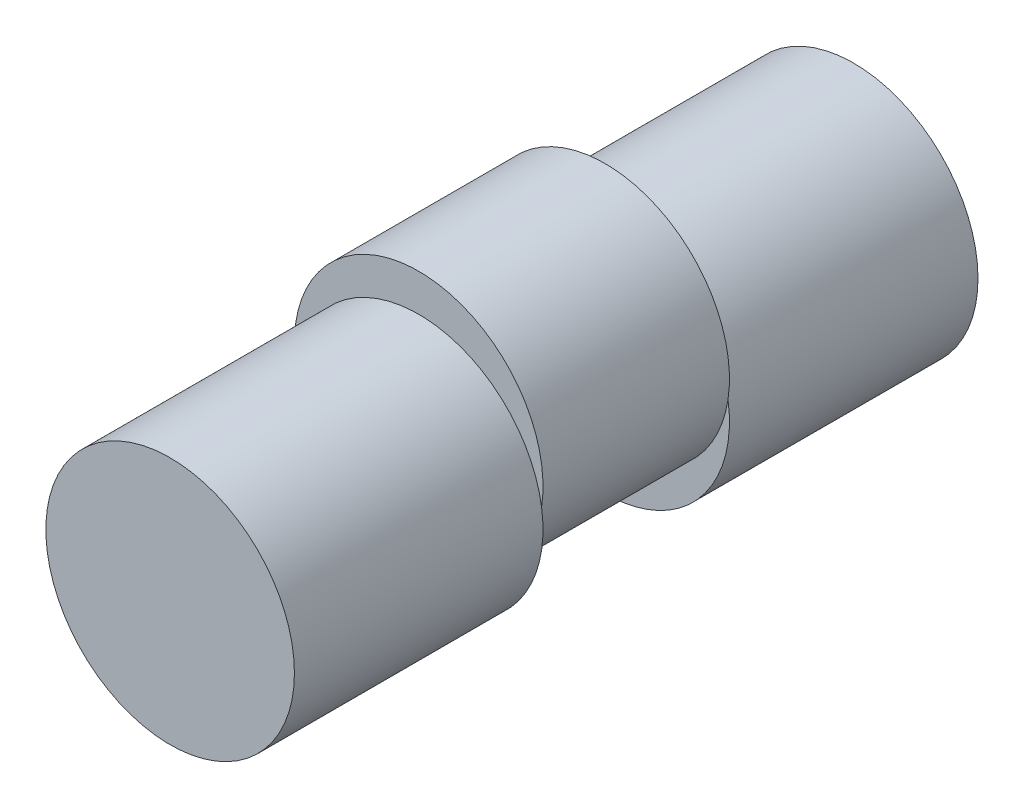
from build123d import *

# Parameters (mm, degrees)
ESQUISSE1_R        = 10
BOSS_EXTRU_1_DEPTH = 20
ESQUISSE2_R        = 10
BOSS_EXTRU_2_DEPTH = 15
ESQUISSE3_R        = 10
BOSS_EXTRU_3_DEPTH = 20


with BuildPart() as part:
    # Esquisse1 → Boss.-Extru.1 (new body)
    with BuildSketch(Plane.XY):
        Circle(ESQUISSE1_R)
    extrude(amount=BOSS_EXTRU_1_DEPTH)

    # Esquisse2 → Boss.-Extru.2 (add)
    with BuildSketch(Plane.XY.offset(20)):
        with Locations(Location((0, 3, 0), (0, 0, 188.626926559))):
            Circle(ESQUISSE2_R)
    extrude(amount=BOSS_EXTRU_2_DEPTH)

    # Esquisse3 → Boss.-Extru.3 (add)
    with BuildSketch(Plane.XY.offset(35)):
        with Locations(Location((0, 0, 0), (0, 0, 171.373073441))):
            Circle(ESQUISSE3_R)
    extrude(amount=BOSS_EXTRU_3_DEPTH)


solid = part.part
